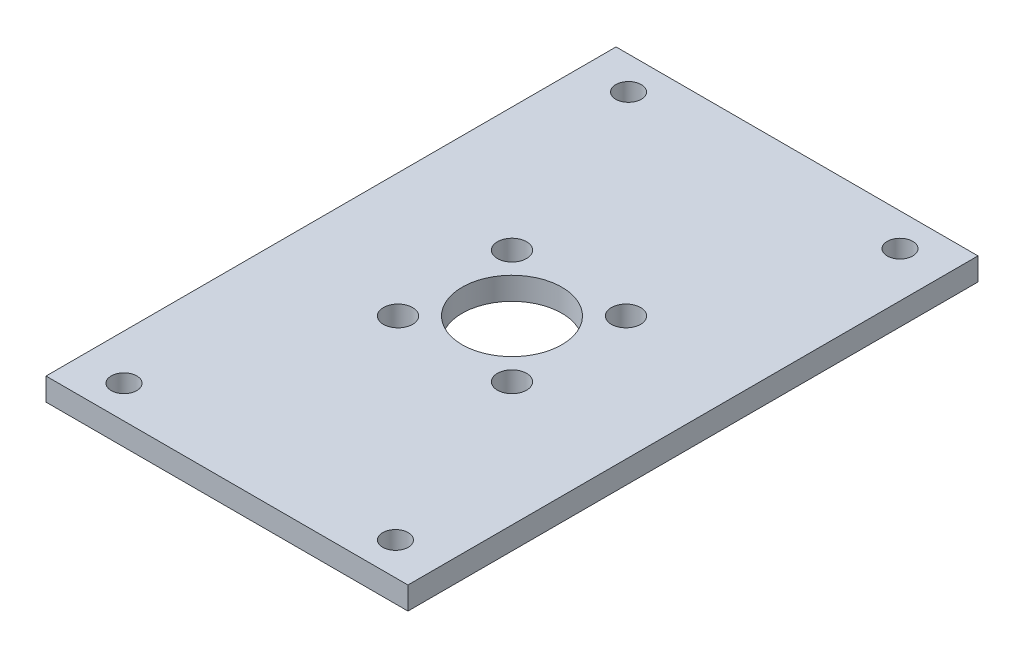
ISO-10303-21;
HEADER;
FILE_DESCRIPTION(('STEP AP214'),'2;1');
FILE_NAME('part.step','',(''),(''),'','','');
FILE_SCHEMA(('AUTOMOTIVE_DESIGN { 1 0 10303 214 1 1 1 1 }'));
ENDSEC;
DATA;
#1=APPLICATION_CONTEXT('core data for automotive mechanical design processes');
#2=APPLICATION_PROTOCOL_DEFINITION('international standard','automotive_design',2000,#1);
#3=PRODUCT_CONTEXT('',#1,'mechanical');
#4=PRODUCT('Part','Part','',(#3));
#5=PRODUCT_RELATED_PRODUCT_CATEGORY('part','',(#4));
#6=PRODUCT_DEFINITION_FORMATION('','',#4);
#7=PRODUCT_DEFINITION_CONTEXT('part definition',#1,'design');
#8=PRODUCT_DEFINITION('design','',#6,#7);
#9=PRODUCT_DEFINITION_SHAPE('','',#8);
#10=(LENGTH_UNIT() NAMED_UNIT(*) SI_UNIT(.MILLI.,.METRE.));
#11=(NAMED_UNIT(*) PLANE_ANGLE_UNIT() SI_UNIT($,.RADIAN.));
#12=(NAMED_UNIT(*) SI_UNIT($,.STERADIAN.) SOLID_ANGLE_UNIT());
#13=UNCERTAINTY_MEASURE_WITH_UNIT(LENGTH_MEASURE(1.E-05),#10,'distance_accuracy_value','');
#14=(GEOMETRIC_REPRESENTATION_CONTEXT(3) GLOBAL_UNCERTAINTY_ASSIGNED_CONTEXT((#13)) GLOBAL_UNIT_ASSIGNED_CONTEXT((#10,
#11,#12)) REPRESENTATION_CONTEXT('',''));
#15=CARTESIAN_POINT('',(0.,0.,0.));
#16=DIRECTION('',(0.,0.,1.));
#17=DIRECTION('',(1.,0.,0.));
#18=AXIS2_PLACEMENT_3D('',#15,#16,#17);
#19=CARTESIAN_POINT('',(-25.4,3.175,-40.005));
#20=DIRECTION('',(0.,0.,1.));
#21=DIRECTION('',(1.,0.,0.));
#22=AXIS2_PLACEMENT_3D('',#19,#20,#21);
#23=PLANE('',#22);
#24=DIRECTION('',(-1.,0.,0.));
#25=VECTOR('',#24,1.);
#26=CARTESIAN_POINT('',(-25.4,0.,-40.005));
#27=LINE('',#26,#25);
#28=CARTESIAN_POINT('',(25.4,0.,-40.005));
#29=VERTEX_POINT('',#28);
#30=CARTESIAN_POINT('',(-25.4,0.,-40.005));
#31=VERTEX_POINT('',#30);
#32=EDGE_CURVE('E100',#29,#31,#27,.T.);
#33=ORIENTED_EDGE('',*,*,#32,.T.);
#34=DIRECTION('',(0.,-1.,0.));
#35=VECTOR('',#34,1.);
#36=CARTESIAN_POINT('',(-25.4,3.175,-40.005));
#37=LINE('',#36,#35);
#38=CARTESIAN_POINT('',(-25.4,3.175,-40.005));
#39=VERTEX_POINT('',#38);
#40=EDGE_CURVE('E11',#39,#31,#37,.T.);
#41=ORIENTED_EDGE('',*,*,#40,.F.);
#42=DIRECTION('',(-1.,0.,0.));
#43=VECTOR('',#42,1.);
#44=CARTESIAN_POINT('',(-25.4,3.175,-40.005));
#45=LINE('',#44,#43);
#46=CARTESIAN_POINT('',(25.4,3.175,-40.005));
#47=VERTEX_POINT('',#46);
#48=EDGE_CURVE('E88',#47,#39,#45,.T.);
#49=ORIENTED_EDGE('',*,*,#48,.F.);
#50=DIRECTION('',(0.,-1.,0.));
#51=VECTOR('',#50,1.);
#52=CARTESIAN_POINT('',(25.4,3.175,-40.005));
#53=LINE('',#52,#51);
#54=EDGE_CURVE('E96',#47,#29,#53,.T.);
#55=ORIENTED_EDGE('',*,*,#54,.T.);
#56=EDGE_LOOP('',(#33,#41,#49,#55));
#57=FACE_BOUND('',#56,.T.);
#58=ADVANCED_FACE('F37',(#57),#23,.F.);
#59=CARTESIAN_POINT('',(-25.4,3.175,-40.005));
#60=DIRECTION('',(1.,0.,0.));
#61=DIRECTION('',(0.,0.,-1.));
#62=AXIS2_PLACEMENT_3D('',#59,#60,#61);
#63=PLANE('',#62);
#64=DIRECTION('',(0.,0.,1.));
#65=VECTOR('',#64,1.);
#66=CARTESIAN_POINT('',(-25.4,0.,-40.005));
#67=LINE('',#66,#65);
#68=CARTESIAN_POINT('',(-25.4,0.,40.005));
#69=VERTEX_POINT('',#68);
#70=EDGE_CURVE('E92',#31,#69,#67,.T.);
#71=ORIENTED_EDGE('',*,*,#70,.T.);
#72=DIRECTION('',(0.,-1.,0.));
#73=VECTOR('',#72,1.);
#74=CARTESIAN_POINT('',(-25.4,3.175,40.005));
#75=LINE('',#74,#73);
#76=CARTESIAN_POINT('',(-25.4,3.175,40.005));
#77=VERTEX_POINT('',#76);
#78=EDGE_CURVE('E45',#77,#69,#75,.T.);
#79=ORIENTED_EDGE('',*,*,#78,.F.);
#80=DIRECTION('',(0.,0.,1.));
#81=VECTOR('',#80,1.);
#82=CARTESIAN_POINT('',(-25.4,3.175,-40.005));
#83=LINE('',#82,#81);
#84=EDGE_CURVE('E83',#39,#77,#83,.T.);
#85=ORIENTED_EDGE('',*,*,#84,.F.);
#86=ORIENTED_EDGE('',*,*,#40,.T.);
#87=EDGE_LOOP('',(#71,#79,#85,#86));
#88=FACE_BOUND('',#87,.T.);
#89=ADVANCED_FACE('F91',(#88),#63,.F.);
#90=CARTESIAN_POINT('',(25.4,3.175,40.005));
#91=DIRECTION('',(0.,0.,-1.));
#92=DIRECTION('',(-1.,0.,0.));
#93=AXIS2_PLACEMENT_3D('',#90,#91,#92);
#94=PLANE('',#93);
#95=DIRECTION('',(1.,0.,0.));
#96=VECTOR('',#95,1.);
#97=CARTESIAN_POINT('',(25.4,0.,40.005));
#98=LINE('',#97,#96);
#99=CARTESIAN_POINT('',(25.4,0.,40.005));
#100=VERTEX_POINT('',#99);
#101=EDGE_CURVE('E70',#69,#100,#98,.T.);
#102=ORIENTED_EDGE('',*,*,#101,.T.);
#103=DIRECTION('',(0.,-1.,0.));
#104=VECTOR('',#103,1.);
#105=CARTESIAN_POINT('',(25.4,3.175,40.005));
#106=LINE('',#105,#104);
#107=CARTESIAN_POINT('',(25.4,3.175,40.005));
#108=VERTEX_POINT('',#107);
#109=EDGE_CURVE('E93',#108,#100,#106,.T.);
#110=ORIENTED_EDGE('',*,*,#109,.F.);
#111=DIRECTION('',(1.,0.,0.));
#112=VECTOR('',#111,1.);
#113=CARTESIAN_POINT('',(25.4,3.175,40.005));
#114=LINE('',#113,#112);
#115=EDGE_CURVE('E86',#77,#108,#114,.T.);
#116=ORIENTED_EDGE('',*,*,#115,.F.);
#117=ORIENTED_EDGE('',*,*,#78,.T.);
#118=EDGE_LOOP('',(#102,#110,#116,#117));
#119=FACE_BOUND('',#118,.T.);
#120=ADVANCED_FACE('F94',(#119),#94,.F.);
#121=CARTESIAN_POINT('',(25.4,3.175,40.005));
#122=DIRECTION('',(-1.,0.,0.));
#123=DIRECTION('',(0.,0.,1.));
#124=AXIS2_PLACEMENT_3D('',#121,#122,#123);
#125=PLANE('',#124);
#126=DIRECTION('',(0.,0.,-1.));
#127=VECTOR('',#126,1.);
#128=CARTESIAN_POINT('',(25.4,0.,40.005));
#129=LINE('',#128,#127);
#130=EDGE_CURVE('E76',#100,#29,#129,.T.);
#131=ORIENTED_EDGE('',*,*,#130,.T.);
#132=ORIENTED_EDGE('',*,*,#54,.F.);
#133=DIRECTION('',(0.,0.,-1.));
#134=VECTOR('',#133,1.);
#135=CARTESIAN_POINT('',(25.4,3.175,40.005));
#136=LINE('',#135,#134);
#137=EDGE_CURVE('E53',#108,#47,#136,.T.);
#138=ORIENTED_EDGE('',*,*,#137,.F.);
#139=ORIENTED_EDGE('',*,*,#109,.T.);
#140=EDGE_LOOP('',(#131,#132,#138,#139));
#141=FACE_BOUND('',#140,.T.);
#142=ADVANCED_FACE('F108',(#141),#125,.F.);
#143=CARTESIAN_POINT('',(0.,3.175,0.));
#144=DIRECTION('',(0.,1.,0.));
#145=DIRECTION('',(0.,0.,1.));
#146=AXIS2_PLACEMENT_3D('',#143,#144,#145);
#147=PLANE('',#146);
#148=CARTESIAN_POINT('',(-8.00000000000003,3.175,-7.99999999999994));
#149=DIRECTION('',(0.,1.,0.));
#150=DIRECTION('',(1.,0.,0.));
#151=AXIS2_PLACEMENT_3D('',#148,#149,#150);
#152=CIRCLE('',#151,2.05);
#153=CARTESIAN_POINT('',(-5.95000000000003,3.175,-7.99999999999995));
#154=VERTEX_POINT('',#153);
#155=EDGE_CURVE('E162',#154,#154,#152,.T.);
#156=ORIENTED_EDGE('',*,*,#155,.F.);
#157=EDGE_LOOP('',(#156));
#158=FACE_BOUND('',#157,.T.);
#159=CARTESIAN_POINT('',(-7.99999999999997,3.175,8.));
#160=DIRECTION('',(0.,1.,0.));
#161=DIRECTION('',(0.,0.,-1.));
#162=AXIS2_PLACEMENT_3D('',#159,#160,#161);
#163=CIRCLE('',#162,2.05);
#164=CARTESIAN_POINT('',(-7.99999999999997,3.175,5.95));
#165=VERTEX_POINT('',#164);
#166=EDGE_CURVE('E156',#165,#165,#163,.T.);
#167=ORIENTED_EDGE('',*,*,#166,.F.);
#168=EDGE_LOOP('',(#167));
#169=FACE_BOUND('',#168,.T.);
#170=CARTESIAN_POINT('',(8.00000000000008,3.175,7.99999999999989));
#171=DIRECTION('',(0.,1.,0.));
#172=DIRECTION('',(-1.,0.,0.));
#173=AXIS2_PLACEMENT_3D('',#170,#171,#172);
#174=CIRCLE('',#173,2.05);
#175=CARTESIAN_POINT('',(5.95000000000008,3.175,7.99999999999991));
#176=VERTEX_POINT('',#175);
#177=EDGE_CURVE('E150',#176,#176,#174,.T.);
#178=ORIENTED_EDGE('',*,*,#177,.F.);
#179=EDGE_LOOP('',(#178));
#180=FACE_BOUND('',#179,.T.);
#181=CARTESIAN_POINT('',(7.99999999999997,3.175,-8.));
#182=DIRECTION('',(0.,1.,0.));
#183=DIRECTION('',(0.,0.,1.));
#184=AXIS2_PLACEMENT_3D('',#181,#182,#183);
#185=CIRCLE('',#184,2.05);
#186=CARTESIAN_POINT('',(7.99999999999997,3.175,-5.95));
#187=VERTEX_POINT('',#186);
#188=EDGE_CURVE('E144',#187,#187,#185,.T.);
#189=ORIENTED_EDGE('',*,*,#188,.F.);
#190=EDGE_LOOP('',(#189));
#191=FACE_BOUND('',#190,.T.);
#192=CARTESIAN_POINT('',(-19.05,3.175,35.4076));
#193=DIRECTION('',(0.,1.,0.));
#194=DIRECTION('',(0.,0.,1.));
#195=AXIS2_PLACEMENT_3D('',#192,#193,#194);
#196=CIRCLE('',#195,1.7907);
#197=CARTESIAN_POINT('',(-19.05,3.175,37.1983));
#198=VERTEX_POINT('',#197);
#199=EDGE_CURVE('E137',#198,#198,#196,.T.);
#200=ORIENTED_EDGE('',*,*,#199,.F.);
#201=EDGE_LOOP('',(#200));
#202=FACE_BOUND('',#201,.T.);
#203=CARTESIAN_POINT('',(19.05,3.175,35.4076));
#204=DIRECTION('',(0.,1.,0.));
#205=DIRECTION('',(0.,0.,1.));
#206=AXIS2_PLACEMENT_3D('',#203,#204,#205);
#207=CIRCLE('',#206,1.7907);
#208=CARTESIAN_POINT('',(19.05,3.175,37.1983));
#209=VERTEX_POINT('',#208);
#210=EDGE_CURVE('E131',#209,#209,#207,.T.);
#211=ORIENTED_EDGE('',*,*,#210,.F.);
#212=EDGE_LOOP('',(#211));
#213=FACE_BOUND('',#212,.T.);
#214=CARTESIAN_POINT('',(0.,3.175,0.));
#215=DIRECTION('',(0.,1.,0.));
#216=DIRECTION('',(0.,0.,1.));
#217=AXIS2_PLACEMENT_3D('',#214,#215,#216);
#218=CIRCLE('',#217,7.);
#219=CARTESIAN_POINT('',(0.,3.175,7.));
#220=VERTEX_POINT('',#219);
#221=EDGE_CURVE('E121',#220,#220,#218,.T.);
#222=ORIENTED_EDGE('',*,*,#221,.F.);
#223=EDGE_LOOP('',(#222));
#224=FACE_BOUND('',#223,.T.);
#225=CARTESIAN_POINT('',(-19.05,3.175,-35.4076));
#226=DIRECTION('',(0.,1.,0.));
#227=DIRECTION('',(0.,0.,1.));
#228=AXIS2_PLACEMENT_3D('',#225,#226,#227);
#229=CIRCLE('',#228,1.7907);
#230=CARTESIAN_POINT('',(-19.05,3.175,-33.6169));
#231=VERTEX_POINT('',#230);
#232=EDGE_CURVE('E103',#231,#231,#229,.T.);
#233=ORIENTED_EDGE('',*,*,#232,.F.);
#234=EDGE_LOOP('',(#233));
#235=FACE_BOUND('',#234,.T.);
#236=CARTESIAN_POINT('',(19.05,3.175,-35.4076));
#237=DIRECTION('',(0.,1.,0.));
#238=DIRECTION('',(0.,0.,1.));
#239=AXIS2_PLACEMENT_3D('',#236,#237,#238);
#240=CIRCLE('',#239,1.7907);
#241=CARTESIAN_POINT('',(19.05,3.175,-33.6169));
#242=VERTEX_POINT('',#241);
#243=EDGE_CURVE('E114',#242,#242,#240,.T.);
#244=ORIENTED_EDGE('',*,*,#243,.F.);
#245=EDGE_LOOP('',(#244));
#246=FACE_BOUND('',#245,.T.);
#247=ORIENTED_EDGE('',*,*,#48,.T.);
#248=ORIENTED_EDGE('',*,*,#84,.T.);
#249=ORIENTED_EDGE('',*,*,#115,.T.);
#250=ORIENTED_EDGE('',*,*,#137,.T.);
#251=EDGE_LOOP('',(#247,#248,#249,#250));
#252=FACE_BOUND('',#251,.T.);
#253=ADVANCED_FACE('F84',(#158,#169,#180,#191,#202,#213,#224,#235,#246,#252),#147,.T.);
#254=CARTESIAN_POINT('',(0.,0.,0.));
#255=DIRECTION('',(0.,1.,0.));
#256=DIRECTION('',(0.,0.,1.));
#257=AXIS2_PLACEMENT_3D('',#254,#255,#256);
#258=PLANE('',#257);
#259=CARTESIAN_POINT('',(-8.00000000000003,0.,-7.99999999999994));
#260=DIRECTION('',(0.,1.,0.));
#261=DIRECTION('',(1.,0.,0.));
#262=AXIS2_PLACEMENT_3D('',#259,#260,#261);
#263=CIRCLE('',#262,2.05);
#264=CARTESIAN_POINT('',(-5.95000000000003,0.,-7.99999999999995));
#265=VERTEX_POINT('',#264);
#266=EDGE_CURVE('E147',#265,#265,#263,.T.);
#267=ORIENTED_EDGE('',*,*,#266,.T.);
#268=EDGE_LOOP('',(#267));
#269=FACE_BOUND('',#268,.T.);
#270=CARTESIAN_POINT('',(-7.99999999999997,0.,8.));
#271=DIRECTION('',(0.,1.,0.));
#272=DIRECTION('',(0.,0.,-1.));
#273=AXIS2_PLACEMENT_3D('',#270,#271,#272);
#274=CIRCLE('',#273,2.05);
#275=CARTESIAN_POINT('',(-7.99999999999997,0.,5.95));
#276=VERTEX_POINT('',#275);
#277=EDGE_CURVE('E159',#276,#276,#274,.T.);
#278=ORIENTED_EDGE('',*,*,#277,.T.);
#279=EDGE_LOOP('',(#278));
#280=FACE_BOUND('',#279,.T.);
#281=CARTESIAN_POINT('',(8.00000000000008,0.,7.99999999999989));
#282=DIRECTION('',(0.,1.,0.));
#283=DIRECTION('',(-1.,0.,0.));
#284=AXIS2_PLACEMENT_3D('',#281,#282,#283);
#285=CIRCLE('',#284,2.05);
#286=CARTESIAN_POINT('',(5.95000000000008,0.,7.99999999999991));
#287=VERTEX_POINT('',#286);
#288=EDGE_CURVE('E153',#287,#287,#285,.T.);
#289=ORIENTED_EDGE('',*,*,#288,.T.);
#290=EDGE_LOOP('',(#289));
#291=FACE_BOUND('',#290,.T.);
#292=CARTESIAN_POINT('',(7.99999999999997,0.,-8.));
#293=DIRECTION('',(0.,1.,0.));
#294=DIRECTION('',(0.,0.,1.));
#295=AXIS2_PLACEMENT_3D('',#292,#293,#294);
#296=CIRCLE('',#295,2.05);
#297=CARTESIAN_POINT('',(7.99999999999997,0.,-5.95));
#298=VERTEX_POINT('',#297);
#299=EDGE_CURVE('E143',#298,#298,#296,.T.);
#300=ORIENTED_EDGE('',*,*,#299,.T.);
#301=EDGE_LOOP('',(#300));
#302=FACE_BOUND('',#301,.T.);
#303=CARTESIAN_POINT('',(-19.05,0.,35.4076));
#304=DIRECTION('',(0.,1.,0.));
#305=DIRECTION('',(0.,0.,-1.));
#306=AXIS2_PLACEMENT_3D('',#303,#304,#305);
#307=CIRCLE('',#306,1.7907);
#308=CARTESIAN_POINT('',(-19.05,0.,33.6169));
#309=VERTEX_POINT('',#308);
#310=EDGE_CURVE('E140',#309,#309,#307,.T.);
#311=ORIENTED_EDGE('',*,*,#310,.T.);
#312=EDGE_LOOP('',(#311));
#313=FACE_BOUND('',#312,.T.);
#314=CARTESIAN_POINT('',(19.05,0.,35.4076));
#315=DIRECTION('',(0.,1.,0.));
#316=DIRECTION('',(0.,0.,-1.));
#317=AXIS2_PLACEMENT_3D('',#314,#315,#316);
#318=CIRCLE('',#317,1.7907);
#319=CARTESIAN_POINT('',(19.05,0.,33.6169));
#320=VERTEX_POINT('',#319);
#321=EDGE_CURVE('E134',#320,#320,#318,.T.);
#322=ORIENTED_EDGE('',*,*,#321,.T.);
#323=EDGE_LOOP('',(#322));
#324=FACE_BOUND('',#323,.T.);
#325=CARTESIAN_POINT('',(0.,0.,0.));
#326=DIRECTION('',(0.,1.,0.));
#327=DIRECTION('',(0.,0.,1.));
#328=AXIS2_PLACEMENT_3D('',#325,#326,#327);
#329=CIRCLE('',#328,7.);
#330=CARTESIAN_POINT('',(0.,0.,7.));
#331=VERTEX_POINT('',#330);
#332=EDGE_CURVE('E128',#331,#331,#329,.T.);
#333=ORIENTED_EDGE('',*,*,#332,.T.);
#334=EDGE_LOOP('',(#333));
#335=FACE_BOUND('',#334,.T.);
#336=CARTESIAN_POINT('',(-19.05,0.,-35.4076));
#337=DIRECTION('',(0.,1.,0.));
#338=DIRECTION('',(0.,0.,1.));
#339=AXIS2_PLACEMENT_3D('',#336,#337,#338);
#340=CIRCLE('',#339,1.7907);
#341=CARTESIAN_POINT('',(-19.05,0.,-33.6169));
#342=VERTEX_POINT('',#341);
#343=EDGE_CURVE('E117',#342,#342,#340,.T.);
#344=ORIENTED_EDGE('',*,*,#343,.T.);
#345=EDGE_LOOP('',(#344));
#346=FACE_BOUND('',#345,.T.);
#347=CARTESIAN_POINT('',(19.05,0.,-35.4076));
#348=DIRECTION('',(0.,1.,0.));
#349=DIRECTION('',(0.,0.,1.));
#350=AXIS2_PLACEMENT_3D('',#347,#348,#349);
#351=CIRCLE('',#350,1.7907);
#352=CARTESIAN_POINT('',(19.05,0.,-33.6169));
#353=VERTEX_POINT('',#352);
#354=EDGE_CURVE('E118',#353,#353,#351,.T.);
#355=ORIENTED_EDGE('',*,*,#354,.T.);
#356=EDGE_LOOP('',(#355));
#357=FACE_BOUND('',#356,.T.);
#358=ORIENTED_EDGE('',*,*,#32,.F.);
#359=ORIENTED_EDGE('',*,*,#130,.F.);
#360=ORIENTED_EDGE('',*,*,#101,.F.);
#361=ORIENTED_EDGE('',*,*,#70,.F.);
#362=EDGE_LOOP('',(#358,#359,#360,#361));
#363=FACE_BOUND('',#362,.T.);
#364=ADVANCED_FACE('F111',(#269,#280,#291,#302,#313,#324,#335,#346,#357,#363),#258,.F.);
#365=CARTESIAN_POINT('',(19.05,8.23986445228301,-35.4076));
#366=DIRECTION('',(0.,-1.,0.));
#367=DIRECTION('',(0.,0.,-1.));
#368=AXIS2_PLACEMENT_3D('',#365,#366,#367);
#369=CYLINDRICAL_SURFACE('',#368,1.7907);
#370=ORIENTED_EDGE('',*,*,#354,.F.);
#371=EDGE_LOOP('',(#370));
#372=FACE_BOUND('',#371,.T.);
#373=ORIENTED_EDGE('',*,*,#243,.T.);
#374=EDGE_LOOP('',(#373));
#375=FACE_BOUND('',#374,.T.);
#376=ADVANCED_FACE('F196',(#372,#375),#369,.F.);
#377=CARTESIAN_POINT('',(-19.05,8.23986445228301,-35.4076));
#378=DIRECTION('',(0.,-1.,0.));
#379=DIRECTION('',(0.,0.,-1.));
#380=AXIS2_PLACEMENT_3D('',#377,#378,#379);
#381=CYLINDRICAL_SURFACE('',#380,1.7907);
#382=ORIENTED_EDGE('',*,*,#343,.F.);
#383=EDGE_LOOP('',(#382));
#384=FACE_BOUND('',#383,.T.);
#385=ORIENTED_EDGE('',*,*,#232,.T.);
#386=EDGE_LOOP('',(#385));
#387=FACE_BOUND('',#386,.T.);
#388=ADVANCED_FACE('F198',(#384,#387),#381,.F.);
#389=CARTESIAN_POINT('',(0.,22.9739898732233,0.));
#390=DIRECTION('',(0.,-1.,0.));
#391=DIRECTION('',(0.,0.,-1.));
#392=AXIS2_PLACEMENT_3D('',#389,#390,#391);
#393=CYLINDRICAL_SURFACE('',#392,7.);
#394=ORIENTED_EDGE('',*,*,#332,.F.);
#395=EDGE_LOOP('',(#394));
#396=FACE_BOUND('',#395,.T.);
#397=ORIENTED_EDGE('',*,*,#221,.T.);
#398=EDGE_LOOP('',(#397));
#399=FACE_BOUND('',#398,.T.);
#400=ADVANCED_FACE('F205',(#396,#399),#393,.F.);
#401=CARTESIAN_POINT('',(19.05,8.23986445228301,35.4076));
#402=DIRECTION('',(0.,-1.,0.));
#403=DIRECTION('',(0.,0.,-1.));
#404=AXIS2_PLACEMENT_3D('',#401,#402,#403);
#405=CYLINDRICAL_SURFACE('',#404,1.7907);
#406=ORIENTED_EDGE('',*,*,#321,.F.);
#407=EDGE_LOOP('',(#406));
#408=FACE_BOUND('',#407,.T.);
#409=ORIENTED_EDGE('',*,*,#210,.T.);
#410=EDGE_LOOP('',(#409));
#411=FACE_BOUND('',#410,.T.);
#412=ADVANCED_FACE('F285',(#408,#411),#405,.F.);
#413=CARTESIAN_POINT('',(-19.05,8.23986445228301,35.4076));
#414=DIRECTION('',(0.,-1.,0.));
#415=DIRECTION('',(0.,0.,-1.));
#416=AXIS2_PLACEMENT_3D('',#413,#414,#415);
#417=CYLINDRICAL_SURFACE('',#416,1.7907);
#418=ORIENTED_EDGE('',*,*,#310,.F.);
#419=EDGE_LOOP('',(#418));
#420=FACE_BOUND('',#419,.T.);
#421=ORIENTED_EDGE('',*,*,#199,.T.);
#422=EDGE_LOOP('',(#421));
#423=FACE_BOUND('',#422,.T.);
#424=ADVANCED_FACE('F276',(#420,#423),#417,.F.);
#425=CARTESIAN_POINT('',(7.99999999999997,0.,-8.));
#426=DIRECTION('',(0.,1.,0.));
#427=DIRECTION('',(0.,0.,1.));
#428=AXIS2_PLACEMENT_3D('',#425,#426,#427);
#429=CYLINDRICAL_SURFACE('',#428,2.05);
#430=ORIENTED_EDGE('',*,*,#299,.F.);
#431=EDGE_LOOP('',(#430));
#432=FACE_BOUND('',#431,.T.);
#433=ORIENTED_EDGE('',*,*,#188,.T.);
#434=EDGE_LOOP('',(#433));
#435=FACE_BOUND('',#434,.T.);
#436=ADVANCED_FACE('F245',(#432,#435),#429,.F.);
#437=CARTESIAN_POINT('',(8.00000000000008,0.,7.99999999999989));
#438=DIRECTION('',(0.,1.,0.));
#439=DIRECTION('',(0.,0.,1.));
#440=AXIS2_PLACEMENT_3D('',#437,#438,#439);
#441=CYLINDRICAL_SURFACE('',#440,2.05);
#442=ORIENTED_EDGE('',*,*,#288,.F.);
#443=EDGE_LOOP('',(#442));
#444=FACE_BOUND('',#443,.T.);
#445=ORIENTED_EDGE('',*,*,#177,.T.);
#446=EDGE_LOOP('',(#445));
#447=FACE_BOUND('',#446,.T.);
#448=ADVANCED_FACE('F240',(#444,#447),#441,.F.);
#449=CARTESIAN_POINT('',(-7.99999999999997,0.,8.));
#450=DIRECTION('',(0.,1.,0.));
#451=DIRECTION('',(0.,0.,1.));
#452=AXIS2_PLACEMENT_3D('',#449,#450,#451);
#453=CYLINDRICAL_SURFACE('',#452,2.05);
#454=ORIENTED_EDGE('',*,*,#277,.F.);
#455=EDGE_LOOP('',(#454));
#456=FACE_BOUND('',#455,.T.);
#457=ORIENTED_EDGE('',*,*,#166,.T.);
#458=EDGE_LOOP('',(#457));
#459=FACE_BOUND('',#458,.T.);
#460=ADVANCED_FACE('F173',(#456,#459),#453,.F.);
#461=CARTESIAN_POINT('',(-8.00000000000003,0.,-7.99999999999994));
#462=DIRECTION('',(0.,1.,0.));
#463=DIRECTION('',(0.,0.,1.));
#464=AXIS2_PLACEMENT_3D('',#461,#462,#463);
#465=CYLINDRICAL_SURFACE('',#464,2.05);
#466=ORIENTED_EDGE('',*,*,#266,.F.);
#467=EDGE_LOOP('',(#466));
#468=FACE_BOUND('',#467,.T.);
#469=ORIENTED_EDGE('',*,*,#155,.T.);
#470=EDGE_LOOP('',(#469));
#471=FACE_BOUND('',#470,.T.);
#472=ADVANCED_FACE('F170',(#468,#471),#465,.F.);
#473=CLOSED_SHELL('',(#58,#89,#120,#142,#253,#364,#376,#388,#400,#412,#424,#436,#448,#460,#472));
#474=MANIFOLD_SOLID_BREP('B2',#473);
#475=ADVANCED_BREP_SHAPE_REPRESENTATION('',(#18,#474),#14);
#476=SHAPE_DEFINITION_REPRESENTATION(#9,#475);
ENDSEC;
END-ISO-10303-21;
